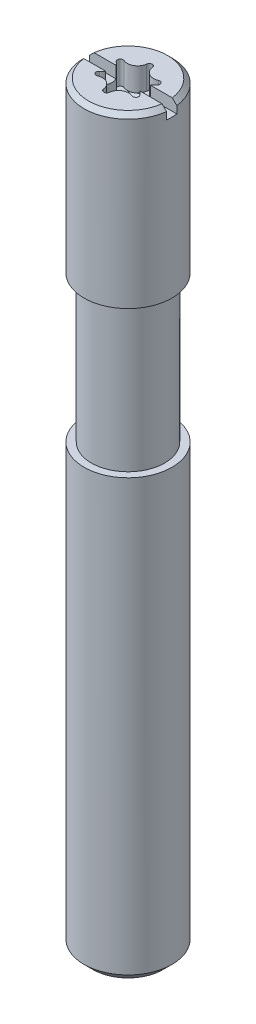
ISO-10303-21;
HEADER;
FILE_DESCRIPTION(('STEP AP214'),'2;1');
FILE_NAME('part.step','',(''),(''),'','','');
FILE_SCHEMA(('AUTOMOTIVE_DESIGN { 1 0 10303 214 1 1 1 1 }'));
ENDSEC;
DATA;
#1=APPLICATION_CONTEXT('core data for automotive mechanical design processes');
#2=APPLICATION_PROTOCOL_DEFINITION('international standard','automotive_design',2000,#1);
#3=PRODUCT_CONTEXT('',#1,'mechanical');
#4=PRODUCT('Part','Part','',(#3));
#5=PRODUCT_RELATED_PRODUCT_CATEGORY('part','',(#4));
#6=PRODUCT_DEFINITION_FORMATION('','',#4);
#7=PRODUCT_DEFINITION_CONTEXT('part definition',#1,'design');
#8=PRODUCT_DEFINITION('design','',#6,#7);
#9=PRODUCT_DEFINITION_SHAPE('','',#8);
#10=(LENGTH_UNIT() NAMED_UNIT(*) SI_UNIT(.MILLI.,.METRE.));
#11=(NAMED_UNIT(*) PLANE_ANGLE_UNIT() SI_UNIT($,.RADIAN.));
#12=(NAMED_UNIT(*) SI_UNIT($,.STERADIAN.) SOLID_ANGLE_UNIT());
#13=UNCERTAINTY_MEASURE_WITH_UNIT(LENGTH_MEASURE(1.E-05),#10,'distance_accuracy_value','');
#14=(GEOMETRIC_REPRESENTATION_CONTEXT(3) GLOBAL_UNCERTAINTY_ASSIGNED_CONTEXT((#13)) GLOBAL_UNIT_ASSIGNED_CONTEXT((#10,
#11,#12)) REPRESENTATION_CONTEXT('',''));
#15=CARTESIAN_POINT('',(0.,0.,0.));
#16=DIRECTION('',(0.,0.,1.));
#17=DIRECTION('',(1.,0.,0.));
#18=AXIS2_PLACEMENT_3D('',#15,#16,#17);
#19=CARTESIAN_POINT('',(-1.52237094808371,39.9,-0.362499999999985));
#20=DIRECTION('',(0.,1.,0.));
#21=DIRECTION('',(0.,0.,1.));
#22=AXIS2_PLACEMENT_3D('',#19,#20,#21);
#23=PLANE('',#22);
#24=CARTESIAN_POINT('',(-0.894502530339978,39.9,1.54932383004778));
#25=DIRECTION('',(0.,1.,0.));
#26=DIRECTION('',(0.,0.,1.));
#27=AXIS2_PLACEMENT_3D('',#24,#25,#26);
#28=CIRCLE('',#27,0.7);
#29=CARTESIAN_POINT('',(-0.198778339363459,39.9,1.47207196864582));
#30=VERTEX_POINT('',#29);
#31=CARTESIAN_POINT('',(-0.464026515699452,39.899999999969,0.997336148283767));
#32=VERTEX_POINT('',#31);
#33=EDGE_CURVE('E359',#30,#32,#28,.T.);
#34=ORIENTED_EDGE('',*,*,#33,.F.);
#35=CARTESIAN_POINT('',(0.,39.9,1.45));
#36=DIRECTION('',(0.,1.,0.));
#37=DIRECTION('',(0.,0.,1.));
#38=AXIS2_PLACEMENT_3D('',#35,#36,#37);
#39=CIRCLE('',#38,0.2);
#40=CARTESIAN_POINT('',(0.198778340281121,39.9,1.47207196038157));
#41=VERTEX_POINT('',#40);
#42=EDGE_CURVE('E568',#30,#41,#39,.T.);
#43=ORIENTED_EDGE('',*,*,#42,.T.);
#44=CARTESIAN_POINT('',(0.894502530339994,39.9,1.54932383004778));
#45=DIRECTION('',(0.,1.,0.));
#46=DIRECTION('',(0.,0.,1.));
#47=AXIS2_PLACEMENT_3D('',#44,#45,#46);
#48=CIRCLE('',#47,0.7);
#49=CARTESIAN_POINT('',(0.464026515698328,39.8999999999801,0.997336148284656));
#50=VERTEX_POINT('',#49);
#51=EDGE_CURVE('E634',#50,#41,#48,.T.);
#52=ORIENTED_EDGE('',*,*,#51,.F.);
#53=CARTESIAN_POINT('',(0.,39.8999999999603,0.));
#54=DIRECTION('',(0.,1.,0.));
#55=DIRECTION('',(0.,0.,1.));
#56=AXIS2_PLACEMENT_3D('',#53,#54,#55);
#57=CIRCLE('',#56,1.09999999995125);
#58=EDGE_CURVE('E595',#50,#32,#57,.F.);
#59=ORIENTED_EDGE('',*,*,#58,.T.);
#60=EDGE_LOOP('',(#34,#43,#52,#59));
#61=FACE_BOUND('',#60,.T.);
#62=ADVANCED_FACE('F14',(#61),#23,.T.);
#63=CARTESIAN_POINT('',(-1.52237094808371,39.9,-0.362499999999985));
#64=DIRECTION('',(0.,1.,0.));
#65=DIRECTION('',(0.,0.,1.));
#66=AXIS2_PLACEMENT_3D('',#63,#64,#65);
#67=PLANE('',#66);
#68=CARTESIAN_POINT('',(0.894502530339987,39.9,-1.54932383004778));
#69=DIRECTION('',(0.,1.,0.));
#70=DIRECTION('',(0.,0.,1.));
#71=AXIS2_PLACEMENT_3D('',#68,#69,#70);
#72=CIRCLE('',#71,0.7);
#73=CARTESIAN_POINT('',(0.198778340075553,39.9,-1.47207196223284));
#74=VERTEX_POINT('',#73);
#75=CARTESIAN_POINT('',(0.464026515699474,39.899999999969,-0.997336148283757));
#76=VERTEX_POINT('',#75);
#77=EDGE_CURVE('E631',#74,#76,#72,.T.);
#78=ORIENTED_EDGE('',*,*,#77,.F.);
#79=CARTESIAN_POINT('',(0.,39.9,-1.45));
#80=DIRECTION('',(0.,1.,0.));
#81=DIRECTION('',(0.,0.,1.));
#82=AXIS2_PLACEMENT_3D('',#79,#80,#81);
#83=CIRCLE('',#82,0.2);
#84=CARTESIAN_POINT('',(-0.198778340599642,39.9,-1.47207195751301));
#85=VERTEX_POINT('',#84);
#86=EDGE_CURVE('E643',#74,#85,#83,.T.);
#87=ORIENTED_EDGE('',*,*,#86,.T.);
#88=CARTESIAN_POINT('',(-0.894502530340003,39.9,-1.54932383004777));
#89=DIRECTION('',(0.,1.,0.));
#90=DIRECTION('',(0.,0.,1.));
#91=AXIS2_PLACEMENT_3D('',#88,#89,#90);
#92=CIRCLE('',#91,0.7);
#93=CARTESIAN_POINT('',(-0.46402651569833,39.8999999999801,-0.997336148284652));
#94=VERTEX_POINT('',#93);
#95=EDGE_CURVE('E279',#94,#85,#92,.T.);
#96=ORIENTED_EDGE('',*,*,#95,.F.);
#97=CARTESIAN_POINT('',(0.,39.8999999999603,0.));
#98=DIRECTION('',(0.,1.,0.));
#99=DIRECTION('',(0.,0.,1.));
#100=AXIS2_PLACEMENT_3D('',#97,#98,#99);
#101=CIRCLE('',#100,1.09999999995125);
#102=EDGE_CURVE('E647',#94,#76,#101,.F.);
#103=ORIENTED_EDGE('',*,*,#102,.T.);
#104=EDGE_LOOP('',(#78,#87,#96,#103));
#105=FACE_BOUND('',#104,.T.);
#106=ADVANCED_FACE('F314',(#105),#67,.T.);
#107=CARTESIAN_POINT('',(0.894502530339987,39.9,-1.54932383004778));
#108=DIRECTION('',(0.,1.,0.));
#109=DIRECTION('',(0.,0.,1.));
#110=AXIS2_PLACEMENT_3D('',#107,#108,#109);
#111=CYLINDRICAL_SURFACE('',#110,0.7);
#112=CARTESIAN_POINT('',(0.894502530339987,39.9,-1.54932383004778));
#113=DIRECTION('',(0.,1.,0.));
#114=DIRECTION('',(0.,0.,1.));
#115=AXIS2_PLACEMENT_3D('',#112,#113,#114);
#116=CIRCLE('',#115,0.7);
#117=CARTESIAN_POINT('',(0.631705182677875,39.8999999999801,-0.900526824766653));
#118=VERTEX_POINT('',#117);
#119=CARTESIAN_POINT('',(1.17546254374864,39.9,-0.908183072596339));
#120=VERTEX_POINT('',#119);
#121=EDGE_CURVE('E627',#118,#120,#116,.T.);
#122=ORIENTED_EDGE('',*,*,#121,.T.);
#123=DIRECTION('',(0.,1.,0.));
#124=VECTOR('',#123,1.);
#125=CARTESIAN_POINT('',(1.17546254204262,39.9,-0.908183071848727));
#126=LINE('',#125,#124);
#127=CARTESIAN_POINT('',(1.17546254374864,41.5,-0.908183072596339));
#128=VERTEX_POINT('',#127);
#129=EDGE_CURVE('E558',#120,#128,#126,.T.);
#130=ORIENTED_EDGE('',*,*,#129,.T.);
#131=CARTESIAN_POINT('',(0.894502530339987,41.5,-1.54932383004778));
#132=DIRECTION('',(0.,1.,0.));
#133=DIRECTION('',(0.,0.,1.));
#134=AXIS2_PLACEMENT_3D('',#131,#132,#133);
#135=CIRCLE('',#134,0.7);
#136=CARTESIAN_POINT('',(0.198778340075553,41.5,-1.47207196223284));
#137=VERTEX_POINT('',#136);
#138=EDGE_CURVE('E438',#128,#137,#135,.F.);
#139=ORIENTED_EDGE('',*,*,#138,.T.);
#140=DIRECTION('',(0.,1.,0.));
#141=VECTOR('',#140,1.);
#142=CARTESIAN_POINT('',(0.198778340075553,39.9,-1.47207196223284));
#143=LINE('',#142,#141);
#144=EDGE_CURVE('E628',#137,#74,#143,.F.);
#145=ORIENTED_EDGE('',*,*,#144,.T.);
#146=ORIENTED_EDGE('',*,*,#77,.T.);
#147=CARTESIAN_POINT('',(0.46402651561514,39.8999999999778,-0.997336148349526));
#148=CARTESIAN_POINT('',(0.489730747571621,39.8973321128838,-0.977317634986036));
#149=CARTESIAN_POINT('',(0.516556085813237,39.8959981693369,-0.959240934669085));
#150=CARTESIAN_POINT('',(0.572448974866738,39.8959981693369,-0.92697116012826));
#151=CARTESIAN_POINT('',(0.601516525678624,39.8973321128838,-0.912778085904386));
#152=CARTESIAN_POINT('',(0.631705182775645,39.8999999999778,-0.900526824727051));
#153=B_SPLINE_CURVE_WITH_KNOTS('',3,(#147,#148,#149,#150,#151,#152),.UNSPECIFIED.,.F.,.F.,(4,2,
4),(0.,0.097125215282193,0.194250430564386),.UNSPECIFIED.);
#154=EDGE_CURVE('E334',#76,#118,#153,.T.);
#155=ORIENTED_EDGE('',*,*,#154,.T.);
#156=EDGE_LOOP('',(#122,#130,#139,#145,#146,#155));
#157=FACE_BOUND('',#156,.T.);
#158=ADVANCED_FACE('F293',(#157),#111,.T.);
#159=CARTESIAN_POINT('',(0.,39.9,-1.45));
#160=DIRECTION('',(0.,1.,0.));
#161=DIRECTION('',(0.,0.,1.));
#162=AXIS2_PLACEMENT_3D('',#159,#160,#161);
#163=CYLINDRICAL_SURFACE('',#162,0.2);
#164=DIRECTION('',(0.,1.,0.));
#165=VECTOR('',#164,1.);
#166=CARTESIAN_POINT('',(-0.198778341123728,39.9,-1.47207195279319));
#167=LINE('',#166,#165);
#168=CARTESIAN_POINT('',(-0.198778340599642,41.5,-1.47207195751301));
#169=VERTEX_POINT('',#168);
#170=EDGE_CURVE('E458',#85,#169,#167,.T.);
#171=ORIENTED_EDGE('',*,*,#170,.F.);
#172=ORIENTED_EDGE('',*,*,#86,.F.);
#173=ORIENTED_EDGE('',*,*,#144,.F.);
#174=CARTESIAN_POINT('',(0.,41.5,-1.45));
#175=DIRECTION('',(0.,1.,0.));
#176=DIRECTION('',(0.,0.,1.));
#177=AXIS2_PLACEMENT_3D('',#174,#175,#176);
#178=CIRCLE('',#177,0.2);
#179=EDGE_CURVE('E642',#169,#137,#178,.F.);
#180=ORIENTED_EDGE('',*,*,#179,.F.);
#181=EDGE_LOOP('',(#171,#172,#173,#180));
#182=FACE_BOUND('',#181,.T.);
#183=ADVANCED_FACE('F291',(#182),#163,.F.);
#184=CARTESIAN_POINT('',(-0.894502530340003,39.9,-1.54932383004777));
#185=DIRECTION('',(0.,1.,0.));
#186=DIRECTION('',(0.,0.,1.));
#187=AXIS2_PLACEMENT_3D('',#184,#185,#186);
#188=CYLINDRICAL_SURFACE('',#187,0.7);
#189=ORIENTED_EDGE('',*,*,#95,.T.);
#190=ORIENTED_EDGE('',*,*,#170,.T.);
#191=CARTESIAN_POINT('',(-0.894502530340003,41.5,-1.54932383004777));
#192=DIRECTION('',(0.,1.,0.));
#193=DIRECTION('',(0.,0.,1.));
#194=AXIS2_PLACEMENT_3D('',#191,#192,#193);
#195=CIRCLE('',#194,0.7);
#196=CARTESIAN_POINT('',(-1.17546253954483,41.5,-0.908183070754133));
#197=VERTEX_POINT('',#196);
#198=EDGE_CURVE('E435',#169,#197,#195,.F.);
#199=ORIENTED_EDGE('',*,*,#198,.T.);
#200=DIRECTION('',(0.,1.,0.));
#201=VECTOR('',#200,1.);
#202=CARTESIAN_POINT('',(-1.17546253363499,39.9,-0.908183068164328));
#203=LINE('',#202,#201);
#204=CARTESIAN_POINT('',(-1.17546253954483,39.9,-0.908183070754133));
#205=VERTEX_POINT('',#204);
#206=EDGE_CURVE('E615',#197,#205,#203,.F.);
#207=ORIENTED_EDGE('',*,*,#206,.T.);
#208=CARTESIAN_POINT('',(-0.894502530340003,39.9,-1.54932383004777));
#209=DIRECTION('',(0.,1.,0.));
#210=DIRECTION('',(0.,0.,1.));
#211=AXIS2_PLACEMENT_3D('',#208,#209,#210);
#212=CIRCLE('',#211,0.7);
#213=CARTESIAN_POINT('',(-0.631705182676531,39.899999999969,-0.900526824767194));
#214=VERTEX_POINT('',#213);
#215=EDGE_CURVE('E304',#205,#214,#212,.T.);
#216=ORIENTED_EDGE('',*,*,#215,.T.);
#217=CARTESIAN_POINT('',(-0.631705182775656,39.8999999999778,-0.900526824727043));
#218=CARTESIAN_POINT('',(-0.601516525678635,39.8973321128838,-0.912778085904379));
#219=CARTESIAN_POINT('',(-0.572448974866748,39.8959981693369,-0.926971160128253));
#220=CARTESIAN_POINT('',(-0.516556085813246,39.8959981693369,-0.959240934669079));
#221=CARTESIAN_POINT('',(-0.48973074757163,39.8973321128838,-0.977317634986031));
#222=CARTESIAN_POINT('',(-0.464026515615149,39.8999999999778,-0.997336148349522));
#223=B_SPLINE_CURVE_WITH_KNOTS('',3,(#217,#218,#219,#220,#221,#222),.UNSPECIFIED.,.F.,.F.,(4,2,
4),(0.,0.0971252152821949,0.19425043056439),.UNSPECIFIED.);
#224=EDGE_CURVE('E296',#214,#94,#223,.T.);
#225=ORIENTED_EDGE('',*,*,#224,.T.);
#226=EDGE_LOOP('',(#189,#190,#199,#207,#216,#225));
#227=FACE_BOUND('',#226,.T.);
#228=ADVANCED_FACE('F286',(#227),#188,.T.);
#229=CARTESIAN_POINT('',(-1.25573683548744,39.9,-0.724999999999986));
#230=DIRECTION('',(0.,1.,0.));
#231=DIRECTION('',(0.,0.,1.));
#232=AXIS2_PLACEMENT_3D('',#229,#230,#231);
#233=CYLINDRICAL_SURFACE('',#232,0.2);
#234=DIRECTION('',(0.,1.,0.));
#235=VECTOR('',#234,1.);
#236=CARTESIAN_POINT('',(-1.37424087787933,39.9,-0.563888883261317));
#237=LINE('',#236,#235);
#238=CARTESIAN_POINT('',(-1.37424088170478,39.9,-0.563888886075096));
#239=VERTEX_POINT('',#238);
#240=CARTESIAN_POINT('',(-1.37424088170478,41.5,-0.563888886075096));
#241=VERTEX_POINT('',#240);
#242=EDGE_CURVE('E469',#239,#241,#237,.T.);
#243=ORIENTED_EDGE('',*,*,#242,.F.);
#244=CARTESIAN_POINT('',(-1.25573683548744,39.9,-0.724999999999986));
#245=DIRECTION('',(0.,1.,0.));
#246=DIRECTION('',(0.,0.,1.));
#247=AXIS2_PLACEMENT_3D('',#244,#245,#246);
#248=CIRCLE('',#247,0.2);
#249=EDGE_CURVE('E609',#205,#239,#248,.T.);
#250=ORIENTED_EDGE('',*,*,#249,.F.);
#251=ORIENTED_EDGE('',*,*,#206,.F.);
#252=CARTESIAN_POINT('',(-1.25573683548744,41.5,-0.724999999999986));
#253=DIRECTION('',(0.,1.,0.));
#254=DIRECTION('',(0.,0.,1.));
#255=AXIS2_PLACEMENT_3D('',#252,#253,#254);
#256=CIRCLE('',#255,0.2);
#257=EDGE_CURVE('E472',#241,#197,#256,.F.);
#258=ORIENTED_EDGE('',*,*,#257,.F.);
#259=EDGE_LOOP('',(#243,#250,#251,#258));
#260=FACE_BOUND('',#259,.T.);
#261=ADVANCED_FACE('F290',(#260),#233,.F.);
#262=CARTESIAN_POINT('',(-1.52237094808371,39.9,-0.362499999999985));
#263=DIRECTION('',(0.,1.,0.));
#264=DIRECTION('',(0.,0.,1.));
#265=AXIS2_PLACEMENT_3D('',#262,#263,#264);
#266=PLANE('',#265);
#267=ORIENTED_EDGE('',*,*,#215,.F.);
#268=ORIENTED_EDGE('',*,*,#249,.T.);
#269=CARTESIAN_POINT('',(-1.78900506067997,39.9,0.));
#270=DIRECTION('',(0.,1.,0.));
#271=DIRECTION('',(0.,0.,1.));
#272=AXIS2_PLACEMENT_3D('',#269,#270,#271);
#273=CIRCLE('',#272,0.7);
#274=CARTESIAN_POINT('',(-1.09573169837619,39.8999999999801,-0.0968093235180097));
#275=VERTEX_POINT('',#274);
#276=EDGE_CURVE('E516',#275,#239,#273,.T.);
#277=ORIENTED_EDGE('',*,*,#276,.F.);
#278=CARTESIAN_POINT('',(0.,39.8999999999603,0.));
#279=DIRECTION('',(0.,1.,0.));
#280=DIRECTION('',(0.,0.,1.));
#281=AXIS2_PLACEMENT_3D('',#278,#279,#280);
#282=CIRCLE('',#281,1.09999999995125);
#283=EDGE_CURVE('E600',#275,#214,#282,.F.);
#284=ORIENTED_EDGE('',*,*,#283,.T.);
#285=EDGE_LOOP('',(#267,#268,#277,#284));
#286=FACE_BOUND('',#285,.T.);
#287=ADVANCED_FACE('F316',(#286),#266,.T.);
#288=CARTESIAN_POINT('',(-1.52237094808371,39.9,-0.362499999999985));
#289=DIRECTION('',(0.,1.,0.));
#290=DIRECTION('',(0.,0.,1.));
#291=AXIS2_PLACEMENT_3D('',#288,#289,#290);
#292=PLANE('',#291);
#293=CARTESIAN_POINT('',(-1.78900506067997,39.9,0.));
#294=DIRECTION('',(0.,1.,0.));
#295=DIRECTION('',(0.,0.,1.));
#296=AXIS2_PLACEMENT_3D('',#293,#294,#295);
#297=CIRCLE('',#296,0.7);
#298=CARTESIAN_POINT('',(-1.09573169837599,39.8999999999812,0.0968093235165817));
#299=VERTEX_POINT('',#298);
#300=CARTESIAN_POINT('',(-1.37424089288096,39.9,0.563888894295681));
#301=VERTEX_POINT('',#300);
#302=EDGE_CURVE('E464',#299,#301,#297,.F.);
#303=ORIENTED_EDGE('',*,*,#302,.T.);
#304=CARTESIAN_POINT('',(-1.25573683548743,39.9,0.725000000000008));
#305=DIRECTION('',(0.,1.,0.));
#306=DIRECTION('',(0.,0.,1.));
#307=AXIS2_PLACEMENT_3D('',#304,#305,#306);
#308=CIRCLE('',#307,0.2);
#309=CARTESIAN_POINT('',(-1.17546254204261,39.9,0.90818307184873));
#310=VERTEX_POINT('',#309);
#311=EDGE_CURVE('E485',#301,#310,#308,.T.);
#312=ORIENTED_EDGE('',*,*,#311,.T.);
#313=CARTESIAN_POINT('',(-0.894502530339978,39.9,1.54932383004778));
#314=DIRECTION('',(0.,1.,0.));
#315=DIRECTION('',(0.,0.,1.));
#316=AXIS2_PLACEMENT_3D('',#313,#314,#315);
#317=CIRCLE('',#316,0.7);
#318=CARTESIAN_POINT('',(-0.631705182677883,39.8999999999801,0.900526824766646));
#319=VERTEX_POINT('',#318);
#320=EDGE_CURVE('E358',#319,#310,#317,.T.);
#321=ORIENTED_EDGE('',*,*,#320,.F.);
#322=CARTESIAN_POINT('',(0.,39.8999999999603,0.));
#323=DIRECTION('',(0.,1.,0.));
#324=DIRECTION('',(0.,0.,1.));
#325=AXIS2_PLACEMENT_3D('',#322,#323,#324);
#326=CIRCLE('',#325,1.09999999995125);
#327=EDGE_CURVE('E597',#319,#299,#326,.F.);
#328=ORIENTED_EDGE('',*,*,#327,.T.);
#329=EDGE_LOOP('',(#303,#312,#321,#328));
#330=FACE_BOUND('',#329,.T.);
#331=ADVANCED_FACE('F530',(#330),#292,.T.);
#332=CARTESIAN_POINT('',(-1.25573683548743,39.9,0.725000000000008));
#333=DIRECTION('',(0.,1.,0.));
#334=DIRECTION('',(0.,0.,1.));
#335=AXIS2_PLACEMENT_3D('',#332,#333,#334);
#336=CYLINDRICAL_SURFACE('',#335,0.2);
#337=DIRECTION('',(0.,1.,0.));
#338=VECTOR('',#337,1.);
#339=CARTESIAN_POINT('',(-1.17546253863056,39.9,0.908183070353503));
#340=LINE('',#339,#338);
#341=CARTESIAN_POINT('',(-1.17546254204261,41.5,0.90818307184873));
#342=VERTEX_POINT('',#341);
#343=EDGE_CURVE('E587',#310,#342,#340,.T.);
#344=ORIENTED_EDGE('',*,*,#343,.F.);
#345=ORIENTED_EDGE('',*,*,#311,.F.);
#346=DIRECTION('',(0.,1.,0.));
#347=VECTOR('',#346,1.);
#348=CARTESIAN_POINT('',(-1.3742409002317,39.9,0.563888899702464));
#349=LINE('',#348,#347);
#350=CARTESIAN_POINT('',(-1.37424089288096,41.5,0.563888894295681));
#351=VERTEX_POINT('',#350);
#352=EDGE_CURVE('E483',#351,#301,#349,.F.);
#353=ORIENTED_EDGE('',*,*,#352,.F.);
#354=CARTESIAN_POINT('',(-1.25573683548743,41.5,0.725000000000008));
#355=DIRECTION('',(0.,1.,0.));
#356=DIRECTION('',(0.,0.,1.));
#357=AXIS2_PLACEMENT_3D('',#354,#355,#356);
#358=CIRCLE('',#357,0.2);
#359=EDGE_CURVE('E482',#342,#351,#358,.F.);
#360=ORIENTED_EDGE('',*,*,#359,.F.);
#361=EDGE_LOOP('',(#344,#345,#353,#360));
#362=FACE_BOUND('',#361,.T.);
#363=ADVANCED_FACE('F366',(#362),#336,.F.);
#364=CARTESIAN_POINT('',(-0.894502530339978,39.9,1.54932383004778));
#365=DIRECTION('',(0.,1.,0.));
#366=DIRECTION('',(0.,0.,1.));
#367=AXIS2_PLACEMENT_3D('',#364,#365,#366);
#368=CYLINDRICAL_SURFACE('',#367,0.7);
#369=ORIENTED_EDGE('',*,*,#320,.T.);
#370=ORIENTED_EDGE('',*,*,#343,.T.);
#371=CARTESIAN_POINT('',(-0.894502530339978,41.5,1.54932383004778));
#372=DIRECTION('',(0.,1.,0.));
#373=DIRECTION('',(0.,0.,1.));
#374=AXIS2_PLACEMENT_3D('',#371,#372,#373);
#375=CIRCLE('',#374,0.7);
#376=CARTESIAN_POINT('',(-0.198778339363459,41.5,1.47207196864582));
#377=VERTEX_POINT('',#376);
#378=EDGE_CURVE('E277',#342,#377,#375,.F.);
#379=ORIENTED_EDGE('',*,*,#378,.T.);
#380=DIRECTION('',(0.,1.,0.));
#381=VECTOR('',#380,1.);
#382=CARTESIAN_POINT('',(-0.198778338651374,39.9,1.4720719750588));
#383=LINE('',#382,#381);
#384=EDGE_CURVE('E636',#377,#30,#383,.F.);
#385=ORIENTED_EDGE('',*,*,#384,.T.);
#386=ORIENTED_EDGE('',*,*,#33,.T.);
#387=CARTESIAN_POINT('',(-0.464026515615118,39.8999999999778,0.997336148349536));
#388=CARTESIAN_POINT('',(-0.489730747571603,39.8973321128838,0.977317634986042));
#389=CARTESIAN_POINT('',(-0.516556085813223,39.8959981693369,0.959240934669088));
#390=CARTESIAN_POINT('',(-0.572448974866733,39.8959981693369,0.926971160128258));
#391=CARTESIAN_POINT('',(-0.601516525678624,39.8973321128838,0.912778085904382));
#392=CARTESIAN_POINT('',(-0.63170518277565,39.8999999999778,0.900526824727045));
#393=B_SPLINE_CURVE_WITH_KNOTS('',3,(#387,#388,#389,#390,#391,#392),.UNSPECIFIED.,.F.,.F.,(4,2,
4),(0.,0.0971252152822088,0.194250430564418),.UNSPECIFIED.);
#394=EDGE_CURVE('E349',#32,#319,#393,.T.);
#395=ORIENTED_EDGE('',*,*,#394,.T.);
#396=EDGE_LOOP('',(#369,#370,#379,#385,#386,#395));
#397=FACE_BOUND('',#396,.T.);
#398=ADVANCED_FACE('F361',(#397),#368,.T.);
#399=CARTESIAN_POINT('',(0.,39.9,1.45));
#400=DIRECTION('',(0.,1.,0.));
#401=DIRECTION('',(0.,0.,1.));
#402=AXIS2_PLACEMENT_3D('',#399,#400,#401);
#403=CYLINDRICAL_SURFACE('',#402,0.2);
#404=DIRECTION('',(0.,1.,0.));
#405=VECTOR('',#404,1.);
#406=CARTESIAN_POINT('',(0.198778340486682,39.9,1.4720719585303));
#407=LINE('',#406,#405);
#408=CARTESIAN_POINT('',(0.198778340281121,41.5,1.47207196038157));
#409=VERTEX_POINT('',#408);
#410=EDGE_CURVE('E632',#41,#409,#407,.T.);
#411=ORIENTED_EDGE('',*,*,#410,.F.);
#412=ORIENTED_EDGE('',*,*,#42,.F.);
#413=ORIENTED_EDGE('',*,*,#384,.F.);
#414=CARTESIAN_POINT('',(0.,41.5,1.45));
#415=DIRECTION('',(0.,1.,0.));
#416=DIRECTION('',(0.,0.,1.));
#417=AXIS2_PLACEMENT_3D('',#414,#415,#416);
#418=CIRCLE('',#417,0.2);
#419=EDGE_CURVE('E566',#409,#377,#418,.F.);
#420=ORIENTED_EDGE('',*,*,#419,.F.);
#421=EDGE_LOOP('',(#411,#412,#413,#420));
#422=FACE_BOUND('',#421,.T.);
#423=ADVANCED_FACE('F365',(#422),#403,.F.);
#424=CARTESIAN_POINT('',(0.894502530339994,39.9,1.54932383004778));
#425=DIRECTION('',(0.,1.,0.));
#426=DIRECTION('',(0.,0.,1.));
#427=AXIS2_PLACEMENT_3D('',#424,#425,#426);
#428=CYLINDRICAL_SURFACE('',#427,0.7);
#429=ORIENTED_EDGE('',*,*,#51,.T.);
#430=ORIENTED_EDGE('',*,*,#410,.T.);
#431=CARTESIAN_POINT('',(0.894502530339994,41.5,1.54932383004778));
#432=DIRECTION('',(0.,1.,0.));
#433=DIRECTION('',(0.,0.,1.));
#434=AXIS2_PLACEMENT_3D('',#431,#432,#433);
#435=CIRCLE('',#434,0.7);
#436=CARTESIAN_POINT('',(1.17546253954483,41.5,0.908183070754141));
#437=VERTEX_POINT('',#436);
#438=EDGE_CURVE('E440',#409,#437,#435,.F.);
#439=ORIENTED_EDGE('',*,*,#438,.T.);
#440=DIRECTION('',(0.,1.,0.));
#441=VECTOR('',#440,1.);
#442=CARTESIAN_POINT('',(1.17546253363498,39.9,0.908183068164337));
#443=LINE('',#442,#441);
#444=CARTESIAN_POINT('',(1.17546253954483,39.9,0.908183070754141));
#445=VERTEX_POINT('',#444);
#446=EDGE_CURVE('E588',#437,#445,#443,.F.);
#447=ORIENTED_EDGE('',*,*,#446,.T.);
#448=CARTESIAN_POINT('',(0.894502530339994,39.9,1.54932383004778));
#449=DIRECTION('',(0.,1.,0.));
#450=DIRECTION('',(0.,0.,1.));
#451=AXIS2_PLACEMENT_3D('',#448,#449,#450);
#452=CIRCLE('',#451,0.7);
#453=CARTESIAN_POINT('',(0.631705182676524,39.899999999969,0.900526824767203));
#454=VERTEX_POINT('',#453);
#455=EDGE_CURVE('E635',#445,#454,#452,.T.);
#456=ORIENTED_EDGE('',*,*,#455,.T.);
#457=CARTESIAN_POINT('',(0.631705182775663,39.8999999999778,0.900526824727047));
#458=CARTESIAN_POINT('',(0.601516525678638,39.8973321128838,0.912778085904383));
#459=CARTESIAN_POINT('',(0.572448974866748,39.8959981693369,0.926971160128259));
#460=CARTESIAN_POINT('',(0.516556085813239,39.8959981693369,0.959240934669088));
#461=CARTESIAN_POINT('',(0.48973074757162,39.8973321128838,0.977317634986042));
#462=CARTESIAN_POINT('',(0.464026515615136,39.8999999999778,0.997336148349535));
#463=B_SPLINE_CURVE_WITH_KNOTS('',3,(#457,#458,#459,#460,#461,#462),.UNSPECIFIED.,.F.,.F.,(4,2,
4),(0.,0.097125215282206,0.194250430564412),.UNSPECIFIED.);
#464=EDGE_CURVE('E341',#454,#50,#463,.T.);
#465=ORIENTED_EDGE('',*,*,#464,.T.);
#466=EDGE_LOOP('',(#429,#430,#439,#447,#456,#465));
#467=FACE_BOUND('',#466,.T.);
#468=ADVANCED_FACE('F368',(#467),#428,.T.);
#469=CARTESIAN_POINT('',(-1.52237094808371,39.9,-0.362499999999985));
#470=DIRECTION('',(0.,1.,0.));
#471=DIRECTION('',(0.,0.,1.));
#472=AXIS2_PLACEMENT_3D('',#469,#470,#471);
#473=PLANE('',#472);
#474=ORIENTED_EDGE('',*,*,#455,.F.);
#475=CARTESIAN_POINT('',(1.25573683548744,39.9,0.725));
#476=DIRECTION('',(0.,1.,0.));
#477=DIRECTION('',(0.,0.,1.));
#478=AXIS2_PLACEMENT_3D('',#475,#476,#477);
#479=CIRCLE('',#478,0.2);
#480=CARTESIAN_POINT('',(1.37424088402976,39.9,0.563888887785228));
#481=VERTEX_POINT('',#480);
#482=EDGE_CURVE('E570',#445,#481,#479,.T.);
#483=ORIENTED_EDGE('',*,*,#482,.T.);
#484=CARTESIAN_POINT('',(1.78900506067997,39.9,0.));
#485=DIRECTION('',(0.,1.,0.));
#486=DIRECTION('',(0.,0.,1.));
#487=AXIS2_PLACEMENT_3D('',#484,#485,#486);
#488=CIRCLE('',#487,0.7);
#489=CARTESIAN_POINT('',(1.09573169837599,39.8999999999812,0.0968093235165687));
#490=VERTEX_POINT('',#489);
#491=EDGE_CURVE('E573',#481,#490,#488,.F.);
#492=ORIENTED_EDGE('',*,*,#491,.T.);
#493=CARTESIAN_POINT('',(0.,39.8999999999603,0.));
#494=DIRECTION('',(0.,1.,0.));
#495=DIRECTION('',(0.,0.,1.));
#496=AXIS2_PLACEMENT_3D('',#493,#494,#495);
#497=CIRCLE('',#496,1.09999999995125);
#498=EDGE_CURVE('E604',#490,#454,#497,.F.);
#499=ORIENTED_EDGE('',*,*,#498,.T.);
#500=EDGE_LOOP('',(#474,#483,#492,#499));
#501=FACE_BOUND('',#500,.T.);
#502=ADVANCED_FACE('F312',(#501),#473,.T.);
#503=CARTESIAN_POINT('',(0.,39.8999999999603,0.));
#504=DIRECTION('',(0.,1.,0.));
#505=DIRECTION('',(0.,0.,1.));
#506=AXIS2_PLACEMENT_3D('',#503,#504,#505);
#507=CONICAL_SURFACE('',#506,1.09999999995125,1.22173047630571);
#508=CARTESIAN_POINT('',(1.13686837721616E-10,39.4996327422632,0.));
#509=VERTEX_POINT('',#508);
#510=VERTEX_LOOP('',#509);
#511=FACE_BOUND('',#510,.T.);
#512=CARTESIAN_POINT('',(0.,39.8999999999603,0.));
#513=DIRECTION('',(0.,1.,0.));
#514=DIRECTION('',(0.,0.,1.));
#515=AXIS2_PLACEMENT_3D('',#512,#513,#514);
#516=CIRCLE('',#515,1.09999999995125);
#517=CARTESIAN_POINT('',(1.09573169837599,39.8999999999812,-0.0968093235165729));
#518=VERTEX_POINT('',#517);
#519=EDGE_CURVE('E602',#118,#518,#516,.F.);
#520=ORIENTED_EDGE('',*,*,#519,.F.);
#521=ORIENTED_EDGE('',*,*,#154,.F.);
#522=ORIENTED_EDGE('',*,*,#102,.F.);
#523=ORIENTED_EDGE('',*,*,#224,.F.);
#524=ORIENTED_EDGE('',*,*,#283,.F.);
#525=CARTESIAN_POINT('',(-1.09573169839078,39.8999999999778,0.0968093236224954));
#526=CARTESIAN_POINT('',(-1.09124727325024,39.8973321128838,0.0645395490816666));
#527=CARTESIAN_POINT('',(-1.08900506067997,39.8959981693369,0.0322697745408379));
#528=CARTESIAN_POINT('',(-1.08900506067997,39.8959981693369,-0.0322697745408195));
#529=CARTESIAN_POINT('',(-1.09124727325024,39.8973321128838,-0.0645395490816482));
#530=CARTESIAN_POINT('',(-1.09573169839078,39.8999999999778,-0.0968093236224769));
#531=B_SPLINE_CURVE_WITH_KNOTS('',3,(#525,#526,#527,#528,#529,#530),.UNSPECIFIED.,.F.,.F.,(4,2,
4),(0.,0.097125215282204,0.194250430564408),.UNSPECIFIED.);
#532=EDGE_CURVE('E321',#299,#275,#531,.T.);
#533=ORIENTED_EDGE('',*,*,#532,.F.);
#534=ORIENTED_EDGE('',*,*,#327,.F.);
#535=ORIENTED_EDGE('',*,*,#394,.F.);
#536=ORIENTED_EDGE('',*,*,#58,.F.);
#537=ORIENTED_EDGE('',*,*,#464,.F.);
#538=ORIENTED_EDGE('',*,*,#498,.F.);
#539=CARTESIAN_POINT('',(1.09573169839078,39.8999999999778,-0.0968093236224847));
#540=CARTESIAN_POINT('',(1.09124727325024,39.8973321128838,-0.0645395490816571));
#541=CARTESIAN_POINT('',(1.08900506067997,39.8959981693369,-0.0322697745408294));
#542=CARTESIAN_POINT('',(1.08900506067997,39.8959981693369,0.0322697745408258));
#543=CARTESIAN_POINT('',(1.09124727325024,39.8973321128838,0.0645395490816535));
#544=CARTESIAN_POINT('',(1.09573169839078,39.8999999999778,0.0968093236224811));
#545=B_SPLINE_CURVE_WITH_KNOTS('',3,(#539,#540,#541,#542,#543,#544),.UNSPECIFIED.,.F.,.F.,(4,2,
4),(0.,0.0971252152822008,0.194250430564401),.UNSPECIFIED.);
#546=EDGE_CURVE('E538',#518,#490,#545,.T.);
#547=ORIENTED_EDGE('',*,*,#546,.F.);
#548=EDGE_LOOP('',(#520,#521,#522,#523,#524,#533,#534,#535,#536,#537,#538,#547));
#549=FACE_BOUND('',#548,.T.);
#550=ADVANCED_FACE('F306',(#511,#549),#507,.F.);
#551=CARTESIAN_POINT('',(-1.52237094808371,39.9,-0.362499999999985));
#552=DIRECTION('',(0.,1.,0.));
#553=DIRECTION('',(0.,0.,1.));
#554=AXIS2_PLACEMENT_3D('',#551,#552,#553);
#555=PLANE('',#554);
#556=CARTESIAN_POINT('',(1.78900506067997,39.9,0.));
#557=DIRECTION('',(0.,1.,0.));
#558=DIRECTION('',(0.,0.,1.));
#559=AXIS2_PLACEMENT_3D('',#556,#557,#558);
#560=CIRCLE('',#559,0.7);
#561=CARTESIAN_POINT('',(1.37424088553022,39.9,-0.563888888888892));
#562=VERTEX_POINT('',#561);
#563=EDGE_CURVE('E477',#518,#562,#560,.F.);
#564=ORIENTED_EDGE('',*,*,#563,.T.);
#565=CARTESIAN_POINT('',(1.25573683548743,39.9,-0.725));
#566=DIRECTION('',(0.,1.,0.));
#567=DIRECTION('',(0.,0.,1.));
#568=AXIS2_PLACEMENT_3D('',#565,#566,#567);
#569=CIRCLE('',#568,0.2);
#570=EDGE_CURVE('E476',#562,#120,#569,.T.);
#571=ORIENTED_EDGE('',*,*,#570,.T.);
#572=ORIENTED_EDGE('',*,*,#121,.F.);
#573=ORIENTED_EDGE('',*,*,#519,.T.);
#574=EDGE_LOOP('',(#564,#571,#572,#573));
#575=FACE_BOUND('',#574,.T.);
#576=ADVANCED_FACE('F311',(#575),#555,.T.);
#577=CARTESIAN_POINT('',(1.25573683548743,39.9,-0.725));
#578=DIRECTION('',(0.,1.,0.));
#579=DIRECTION('',(0.,0.,1.));
#580=AXIS2_PLACEMENT_3D('',#577,#578,#579);
#581=CYLINDRICAL_SURFACE('',#580,0.2);
#582=ORIENTED_EDGE('',*,*,#129,.F.);
#583=ORIENTED_EDGE('',*,*,#570,.F.);
#584=DIRECTION('',(0.,1.,0.));
#585=VECTOR('',#584,1.);
#586=CARTESIAN_POINT('',(1.37424088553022,39.9,-0.563888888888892));
#587=LINE('',#586,#585);
#588=CARTESIAN_POINT('',(1.37424088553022,41.5,-0.563888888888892));
#589=VERTEX_POINT('',#588);
#590=EDGE_CURVE('E474',#589,#562,#587,.F.);
#591=ORIENTED_EDGE('',*,*,#590,.F.);
#592=CARTESIAN_POINT('',(1.25573683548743,41.5,-0.725));
#593=DIRECTION('',(0.,1.,0.));
#594=DIRECTION('',(0.,0.,1.));
#595=AXIS2_PLACEMENT_3D('',#592,#593,#594);
#596=CIRCLE('',#595,0.2);
#597=EDGE_CURVE('E473',#128,#589,#596,.F.);
#598=ORIENTED_EDGE('',*,*,#597,.F.);
#599=EDGE_LOOP('',(#582,#583,#591,#598));
#600=FACE_BOUND('',#599,.T.);
#601=ADVANCED_FACE('F557',(#600),#581,.F.);
#602=CARTESIAN_POINT('',(1.25573683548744,39.9,0.725));
#603=DIRECTION('',(0.,1.,0.));
#604=DIRECTION('',(0.,0.,1.));
#605=AXIS2_PLACEMENT_3D('',#602,#603,#604);
#606=CYLINDRICAL_SURFACE('',#605,0.2);
#607=DIRECTION('',(0.,1.,0.));
#608=VECTOR('',#607,1.);
#609=CARTESIAN_POINT('',(1.3742408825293,39.9,0.563888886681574));
#610=LINE('',#609,#608);
#611=CARTESIAN_POINT('',(1.37424088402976,41.5,0.563888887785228));
#612=VERTEX_POINT('',#611);
#613=EDGE_CURVE('E478',#481,#612,#610,.T.);
#614=ORIENTED_EDGE('',*,*,#613,.F.);
#615=ORIENTED_EDGE('',*,*,#482,.F.);
#616=ORIENTED_EDGE('',*,*,#446,.F.);
#617=CARTESIAN_POINT('',(1.25573683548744,41.5,0.725));
#618=DIRECTION('',(0.,1.,0.));
#619=DIRECTION('',(0.,0.,1.));
#620=AXIS2_PLACEMENT_3D('',#617,#618,#619);
#621=CIRCLE('',#620,0.2);
#622=EDGE_CURVE('E481',#612,#437,#621,.F.);
#623=ORIENTED_EDGE('',*,*,#622,.F.);
#624=EDGE_LOOP('',(#614,#615,#616,#623));
#625=FACE_BOUND('',#624,.T.);
#626=ADVANCED_FACE('F659',(#625),#606,.F.);
#627=CARTESIAN_POINT('',(0.,41.5,0.));
#628=DIRECTION('',(0.,-1.,0.));
#629=DIRECTION('',(0.,0.,-1.));
#630=AXIS2_PLACEMENT_3D('',#627,#628,#629);
#631=PLANE('',#630);
#632=CARTESIAN_POINT('',(0.,41.4999999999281,0.));
#633=DIRECTION('',(0.,-1.,0.));
#634=DIRECTION('',(0.,0.,-1.));
#635=AXIS2_PLACEMENT_3D('',#632,#633,#634);
#636=CIRCLE('',#635,2.69350000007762);
#637=CARTESIAN_POINT('',(-2.67066326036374,41.4999999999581,-0.35));
#638=VERTEX_POINT('',#637);
#639=CARTESIAN_POINT('',(2.67066326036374,41.4999999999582,-0.35));
#640=VERTEX_POINT('',#639);
#641=EDGE_CURVE('E224',#638,#640,#636,.T.);
#642=ORIENTED_EDGE('',*,*,#641,.F.);
#643=DIRECTION('',(1.,0.,0.));
#644=VECTOR('',#643,1.);
#645=CARTESIAN_POINT('',(0.,41.5,-0.35));
#646=LINE('',#645,#644);
#647=CARTESIAN_POINT('',(-1.18278727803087,41.5,-0.35));
#648=VERTEX_POINT('',#647);
#649=EDGE_CURVE('E251',#648,#638,#646,.F.);
#650=ORIENTED_EDGE('',*,*,#649,.F.);
#651=CARTESIAN_POINT('',(-1.78900506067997,41.5,0.));
#652=DIRECTION('',(0.,1.,0.));
#653=DIRECTION('',(0.,0.,1.));
#654=AXIS2_PLACEMENT_3D('',#651,#652,#653);
#655=CIRCLE('',#654,0.7);
#656=EDGE_CURVE('E490',#241,#648,#655,.F.);
#657=ORIENTED_EDGE('',*,*,#656,.F.);
#658=ORIENTED_EDGE('',*,*,#257,.T.);
#659=ORIENTED_EDGE('',*,*,#198,.F.);
#660=ORIENTED_EDGE('',*,*,#179,.T.);
#661=ORIENTED_EDGE('',*,*,#138,.F.);
#662=ORIENTED_EDGE('',*,*,#597,.T.);
#663=CARTESIAN_POINT('',(1.78900506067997,41.5,0.));
#664=DIRECTION('',(0.,1.,0.));
#665=DIRECTION('',(0.,0.,1.));
#666=AXIS2_PLACEMENT_3D('',#663,#664,#665);
#667=CIRCLE('',#666,0.7);
#668=CARTESIAN_POINT('',(1.18278727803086,41.5,-0.35));
#669=VERTEX_POINT('',#668);
#670=EDGE_CURVE('E497',#669,#589,#667,.F.);
#671=ORIENTED_EDGE('',*,*,#670,.F.);
#672=DIRECTION('',(1.,0.,0.));
#673=VECTOR('',#672,1.);
#674=CARTESIAN_POINT('',(0.,41.5,-0.35));
#675=LINE('',#674,#673);
#676=EDGE_CURVE('E225',#640,#669,#675,.F.);
#677=ORIENTED_EDGE('',*,*,#676,.F.);
#678=EDGE_LOOP('',(#642,#650,#657,#658,#659,#660,#661,#662,#671,#677));
#679=FACE_BOUND('',#678,.T.);
#680=ADVANCED_FACE('F534',(#679),#631,.F.);
#681=CARTESIAN_POINT('',(-1.78900506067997,39.9,0.));
#682=DIRECTION('',(0.,1.,0.));
#683=DIRECTION('',(0.,0.,1.));
#684=AXIS2_PLACEMENT_3D('',#681,#682,#683);
#685=CYLINDRICAL_SURFACE('',#684,0.7);
#686=DIRECTION('',(0.,1.,0.));
#687=VECTOR('',#686,1.);
#688=CARTESIAN_POINT('',(-1.18278727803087,39.9,-0.35));
#689=LINE('',#688,#687);
#690=CARTESIAN_POINT('',(-1.18278727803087,40.7,-0.35));
#691=VERTEX_POINT('',#690);
#692=EDGE_CURVE('E468',#648,#691,#689,.F.);
#693=ORIENTED_EDGE('',*,*,#692,.T.);
#694=CARTESIAN_POINT('',(-1.78900506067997,40.7,0.));
#695=DIRECTION('',(0.,1.,0.));
#696=DIRECTION('',(0.,0.,1.));
#697=AXIS2_PLACEMENT_3D('',#694,#695,#696);
#698=CIRCLE('',#697,0.7);
#699=CARTESIAN_POINT('',(-1.18278727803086,40.7,0.35));
#700=VERTEX_POINT('',#699);
#701=EDGE_CURVE('E236',#700,#691,#698,.T.);
#702=ORIENTED_EDGE('',*,*,#701,.F.);
#703=DIRECTION('',(0.,1.,0.));
#704=VECTOR('',#703,1.);
#705=CARTESIAN_POINT('',(-1.18278727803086,0.,0.35));
#706=LINE('',#705,#704);
#707=CARTESIAN_POINT('',(-1.18278727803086,41.5,0.35));
#708=VERTEX_POINT('',#707);
#709=EDGE_CURVE('E215',#700,#708,#706,.T.);
#710=ORIENTED_EDGE('',*,*,#709,.T.);
#711=CARTESIAN_POINT('',(-1.78900506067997,41.5,0.));
#712=DIRECTION('',(0.,1.,0.));
#713=DIRECTION('',(0.,0.,1.));
#714=AXIS2_PLACEMENT_3D('',#711,#712,#713);
#715=CIRCLE('',#714,0.7);
#716=EDGE_CURVE('E212',#708,#351,#715,.F.);
#717=ORIENTED_EDGE('',*,*,#716,.T.);
#718=ORIENTED_EDGE('',*,*,#352,.T.);
#719=ORIENTED_EDGE('',*,*,#302,.F.);
#720=ORIENTED_EDGE('',*,*,#532,.T.);
#721=ORIENTED_EDGE('',*,*,#276,.T.);
#722=ORIENTED_EDGE('',*,*,#242,.T.);
#723=ORIENTED_EDGE('',*,*,#656,.T.);
#724=EDGE_LOOP('',(#693,#702,#710,#717,#718,#719,#720,#721,#722,#723));
#725=FACE_BOUND('',#724,.T.);
#726=ADVANCED_FACE('F508',(#725),#685,.T.);
#727=CARTESIAN_POINT('',(0.,41.5,0.));
#728=DIRECTION('',(0.,-1.,0.));
#729=DIRECTION('',(0.,0.,-1.));
#730=AXIS2_PLACEMENT_3D('',#727,#728,#729);
#731=PLANE('',#730);
#732=DIRECTION('',(1.,0.,0.));
#733=VECTOR('',#732,1.);
#734=CARTESIAN_POINT('',(0.,41.5,0.35));
#735=LINE('',#734,#733);
#736=CARTESIAN_POINT('',(2.67066326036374,41.4999999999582,0.35));
#737=VERTEX_POINT('',#736);
#738=CARTESIAN_POINT('',(1.18278727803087,41.5,0.35));
#739=VERTEX_POINT('',#738);
#740=EDGE_CURVE('E465',#737,#739,#735,.F.);
#741=ORIENTED_EDGE('',*,*,#740,.T.);
#742=CARTESIAN_POINT('',(1.78900506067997,41.5,0.));
#743=DIRECTION('',(0.,1.,0.));
#744=DIRECTION('',(0.,0.,1.));
#745=AXIS2_PLACEMENT_3D('',#742,#743,#744);
#746=CIRCLE('',#745,0.7);
#747=EDGE_CURVE('E544',#612,#739,#746,.F.);
#748=ORIENTED_EDGE('',*,*,#747,.F.);
#749=ORIENTED_EDGE('',*,*,#622,.T.);
#750=ORIENTED_EDGE('',*,*,#438,.F.);
#751=ORIENTED_EDGE('',*,*,#419,.T.);
#752=ORIENTED_EDGE('',*,*,#378,.F.);
#753=ORIENTED_EDGE('',*,*,#359,.T.);
#754=ORIENTED_EDGE('',*,*,#716,.F.);
#755=DIRECTION('',(1.,0.,0.));
#756=VECTOR('',#755,1.);
#757=CARTESIAN_POINT('',(0.,41.5,0.35));
#758=LINE('',#757,#756);
#759=CARTESIAN_POINT('',(-2.67066326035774,41.4999999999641,0.35));
#760=VERTEX_POINT('',#759);
#761=EDGE_CURVE('E206',#708,#760,#758,.F.);
#762=ORIENTED_EDGE('',*,*,#761,.T.);
#763=CARTESIAN_POINT('',(0.,41.4999999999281,0.));
#764=DIRECTION('',(0.,-1.,0.));
#765=DIRECTION('',(0.,0.,-1.));
#766=AXIS2_PLACEMENT_3D('',#763,#764,#765);
#767=CIRCLE('',#766,2.69350000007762);
#768=EDGE_CURVE('E209',#737,#760,#767,.T.);
#769=ORIENTED_EDGE('',*,*,#768,.F.);
#770=EDGE_LOOP('',(#741,#748,#749,#750,#751,#752,#753,#754,#762,#769));
#771=FACE_BOUND('',#770,.T.);
#772=ADVANCED_FACE('F208',(#771),#731,.F.);
#773=CARTESIAN_POINT('',(1.78900506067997,39.9,0.));
#774=DIRECTION('',(0.,1.,0.));
#775=DIRECTION('',(0.,0.,1.));
#776=AXIS2_PLACEMENT_3D('',#773,#774,#775);
#777=CYLINDRICAL_SURFACE('',#776,0.7);
#778=ORIENTED_EDGE('',*,*,#613,.T.);
#779=ORIENTED_EDGE('',*,*,#747,.T.);
#780=DIRECTION('',(0.,1.,0.));
#781=VECTOR('',#780,1.);
#782=CARTESIAN_POINT('',(1.18278727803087,0.,0.35));
#783=LINE('',#782,#781);
#784=CARTESIAN_POINT('',(1.18278727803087,40.7,0.35));
#785=VERTEX_POINT('',#784);
#786=EDGE_CURVE('E461',#739,#785,#783,.F.);
#787=ORIENTED_EDGE('',*,*,#786,.T.);
#788=CARTESIAN_POINT('',(1.78900506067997,40.7,0.));
#789=DIRECTION('',(0.,1.,0.));
#790=DIRECTION('',(0.,0.,1.));
#791=AXIS2_PLACEMENT_3D('',#788,#789,#790);
#792=CIRCLE('',#791,0.7);
#793=CARTESIAN_POINT('',(1.18278727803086,40.7,-0.35));
#794=VERTEX_POINT('',#793);
#795=EDGE_CURVE('E250',#785,#794,#792,.F.);
#796=ORIENTED_EDGE('',*,*,#795,.T.);
#797=DIRECTION('',(0.,1.,0.));
#798=VECTOR('',#797,1.);
#799=CARTESIAN_POINT('',(1.18278727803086,39.9,-0.35));
#800=LINE('',#799,#798);
#801=EDGE_CURVE('E494',#794,#669,#800,.T.);
#802=ORIENTED_EDGE('',*,*,#801,.T.);
#803=ORIENTED_EDGE('',*,*,#670,.T.);
#804=ORIENTED_EDGE('',*,*,#590,.T.);
#805=ORIENTED_EDGE('',*,*,#563,.F.);
#806=ORIENTED_EDGE('',*,*,#546,.T.);
#807=ORIENTED_EDGE('',*,*,#491,.F.);
#808=EDGE_LOOP('',(#778,#779,#787,#796,#802,#803,#804,#805,#806,#807));
#809=FACE_BOUND('',#808,.T.);
#810=ADVANCED_FACE('F285',(#809),#777,.T.);
#811=CARTESIAN_POINT('',(0.,0.,-0.35));
#812=DIRECTION('',(0.,0.,1.));
#813=DIRECTION('',(1.,0.,0.));
#814=AXIS2_PLACEMENT_3D('',#811,#812,#813);
#815=PLANE('',#814);
#816=ORIENTED_EDGE('',*,*,#801,.F.);
#817=DIRECTION('',(1.,0.,0.));
#818=VECTOR('',#817,1.);
#819=CARTESIAN_POINT('',(0.,40.7,-0.35));
#820=LINE('',#819,#818);
#821=CARTESIAN_POINT('',(2.97951338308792,40.7,-0.35));
#822=VERTEX_POINT('',#821);
#823=EDGE_CURVE('E275',#794,#822,#820,.T.);
#824=ORIENTED_EDGE('',*,*,#823,.T.);
#825=DIRECTION('',(0.,1.,0.));
#826=VECTOR('',#825,1.);
#827=CARTESIAN_POINT('',(2.97951338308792,0.,-0.35));
#828=LINE('',#827,#826);
#829=CARTESIAN_POINT('',(2.97951338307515,41.1934999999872,-0.35));
#830=VERTEX_POINT('',#829);
#831=EDGE_CURVE('E276',#822,#830,#828,.T.);
#832=ORIENTED_EDGE('',*,*,#831,.T.);
#833=CARTESIAN_POINT('',(2.97951338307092,41.1934999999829,-0.350000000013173));
#834=CARTESIAN_POINT('',(2.92805952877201,41.2446046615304,-0.350000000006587));
#835=CARTESIAN_POINT('',(2.87659509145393,41.2956986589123,-0.350000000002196));
#836=CARTESIAN_POINT('',(2.77364505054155,41.3978653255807,-0.349999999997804));
#837=CARTESIAN_POINT('',(2.72215944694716,41.4489379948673,-0.349999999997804));
#838=CARTESIAN_POINT('',(2.67066326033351,41.4999999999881,-0.35));
#839=B_SPLINE_CURVE_WITH_KNOTS('',3,(#833,#834,#835,#836,#837,#838),.UNSPECIFIED.,.F.,.F.,(4,2,
4),(0.,0.217560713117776,0.435121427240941),.UNSPECIFIED.);
#840=EDGE_CURVE('E39',#830,#640,#839,.T.);
#841=ORIENTED_EDGE('',*,*,#840,.T.);
#842=ORIENTED_EDGE('',*,*,#676,.T.);
#843=EDGE_LOOP('',(#816,#824,#832,#841,#842));
#844=FACE_BOUND('',#843,.T.);
#845=ADVANCED_FACE('F260',(#844),#815,.T.);
#846=CARTESIAN_POINT('',(0.,41.1935000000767,0.));
#847=DIRECTION('',(0.,-1.,0.));
#848=DIRECTION('',(0.,0.,-1.));
#849=AXIS2_PLACEMENT_3D('',#846,#847,#848);
#850=CONICAL_SURFACE('',#849,2.99999999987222,0.785398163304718);
#851=CARTESIAN_POINT('',(-2.67066326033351,41.4999999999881,-0.35));
#852=CARTESIAN_POINT('',(-2.72215944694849,41.4489379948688,-0.35));
#853=CARTESIAN_POINT('',(-2.77364505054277,41.3978653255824,-0.35));
#854=CARTESIAN_POINT('',(-2.87659509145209,41.2956986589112,-0.35));
#855=CARTESIAN_POINT('',(-2.92805952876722,41.2446046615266,-0.35));
#856=CARTESIAN_POINT('',(-2.97951338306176,41.1934999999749,-0.35));
#857=B_SPLINE_CURVE_WITH_KNOTS('',3,(#851,#852,#853,#854,#855,#856),.UNSPECIFIED.,.F.,.F.,(4,2,
4),(0.,0.21756071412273,0.435121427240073),.UNSPECIFIED.);
#858=CARTESIAN_POINT('',(-2.97951338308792,41.1934999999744,-0.35));
#859=VERTEX_POINT('',#858);
#860=EDGE_CURVE('E241',#638,#859,#857,.T.);
#861=ORIENTED_EDGE('',*,*,#860,.F.);
#862=ORIENTED_EDGE('',*,*,#641,.T.);
#863=ORIENTED_EDGE('',*,*,#840,.F.);
#864=CARTESIAN_POINT('',(0.,41.1935,0.));
#865=DIRECTION('',(0.,-1.,0.));
#866=DIRECTION('',(0.,0.,-1.));
#867=AXIS2_PLACEMENT_3D('',#864,#865,#866);
#868=CIRCLE('',#867,3.);
#869=EDGE_CURVE('E423',#859,#830,#868,.T.);
#870=ORIENTED_EDGE('',*,*,#869,.F.);
#871=EDGE_LOOP('',(#861,#862,#863,#870));
#872=FACE_BOUND('',#871,.T.);
#873=ADVANCED_FACE('F256',(#872),#850,.T.);
#874=CARTESIAN_POINT('',(0.,0.,-0.35));
#875=DIRECTION('',(0.,0.,1.));
#876=DIRECTION('',(1.,0.,0.));
#877=AXIS2_PLACEMENT_3D('',#874,#875,#876);
#878=PLANE('',#877);
#879=ORIENTED_EDGE('',*,*,#649,.T.);
#880=ORIENTED_EDGE('',*,*,#860,.T.);
#881=DIRECTION('',(0.,1.,0.));
#882=VECTOR('',#881,1.);
#883=CARTESIAN_POINT('',(-2.97951338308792,0.,-0.35));
#884=LINE('',#883,#882);
#885=CARTESIAN_POINT('',(-2.97951338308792,40.7,-0.35));
#886=VERTEX_POINT('',#885);
#887=EDGE_CURVE('E240',#859,#886,#884,.F.);
#888=ORIENTED_EDGE('',*,*,#887,.T.);
#889=DIRECTION('',(1.,0.,0.));
#890=VECTOR('',#889,1.);
#891=CARTESIAN_POINT('',(0.,40.7,-0.35));
#892=LINE('',#891,#890);
#893=EDGE_CURVE('E493',#886,#691,#892,.T.);
#894=ORIENTED_EDGE('',*,*,#893,.T.);
#895=ORIENTED_EDGE('',*,*,#692,.F.);
#896=EDGE_LOOP('',(#879,#880,#888,#894,#895));
#897=FACE_BOUND('',#896,.T.);
#898=ADVANCED_FACE('F253',(#897),#878,.T.);
#899=CARTESIAN_POINT('',(-4.,40.7,0.35));
#900=DIRECTION('',(0.,1.,0.));
#901=DIRECTION('',(0.,0.,1.));
#902=AXIS2_PLACEMENT_3D('',#899,#900,#901);
#903=PLANE('',#902);
#904=ORIENTED_EDGE('',*,*,#701,.T.);
#905=ORIENTED_EDGE('',*,*,#893,.F.);
#906=CARTESIAN_POINT('',(0.,40.7,0.));
#907=DIRECTION('',(0.,-1.,0.));
#908=DIRECTION('',(0.,0.,-1.));
#909=AXIS2_PLACEMENT_3D('',#906,#907,#908);
#910=CIRCLE('',#909,3.);
#911=CARTESIAN_POINT('',(-2.97951338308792,40.7,0.35));
#912=VERTEX_POINT('',#911);
#913=EDGE_CURVE('E230',#886,#912,#910,.F.);
#914=ORIENTED_EDGE('',*,*,#913,.T.);
#915=DIRECTION('',(1.,0.,0.));
#916=VECTOR('',#915,1.);
#917=CARTESIAN_POINT('',(-4.,40.7,0.35));
#918=LINE('',#917,#916);
#919=EDGE_CURVE('E232',#912,#700,#918,.T.);
#920=ORIENTED_EDGE('',*,*,#919,.T.);
#921=EDGE_LOOP('',(#904,#905,#914,#920));
#922=FACE_BOUND('',#921,.T.);
#923=ADVANCED_FACE('F509',(#922),#903,.T.);
#924=CARTESIAN_POINT('',(0.,0.,0.35));
#925=DIRECTION('',(0.,0.,1.));
#926=DIRECTION('',(1.,0.,0.));
#927=AXIS2_PLACEMENT_3D('',#924,#925,#926);
#928=PLANE('',#927);
#929=ORIENTED_EDGE('',*,*,#761,.F.);
#930=ORIENTED_EDGE('',*,*,#709,.F.);
#931=ORIENTED_EDGE('',*,*,#919,.F.);
#932=DIRECTION('',(0.,1.,0.));
#933=VECTOR('',#932,1.);
#934=CARTESIAN_POINT('',(-2.97951338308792,0.,0.35));
#935=LINE('',#934,#933);
#936=CARTESIAN_POINT('',(-2.97951338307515,41.1934999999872,0.35));
#937=VERTEX_POINT('',#936);
#938=EDGE_CURVE('E229',#937,#912,#935,.F.);
#939=ORIENTED_EDGE('',*,*,#938,.F.);
#940=CARTESIAN_POINT('',(-2.67066326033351,41.4999999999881,0.35));
#941=CARTESIAN_POINT('',(-2.72215944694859,41.4489379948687,0.35));
#942=CARTESIAN_POINT('',(-2.77364505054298,41.3978653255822,0.35));
#943=CARTESIAN_POINT('',(-2.8765950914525,41.2956986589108,0.35));
#944=CARTESIAN_POINT('',(-2.92805952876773,41.2446046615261,0.35));
#945=CARTESIAN_POINT('',(-2.97951338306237,41.1934999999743,0.35));
#946=B_SPLINE_CURVE_WITH_KNOTS('',3,(#940,#941,#942,#943,#944,#945),.UNSPECIFIED.,.F.,.F.,(4,2,
4),(0.,0.217560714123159,0.435121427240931),.UNSPECIFIED.);
#947=EDGE_CURVE('E19',#760,#937,#946,.T.);
#948=ORIENTED_EDGE('',*,*,#947,.F.);
#949=EDGE_LOOP('',(#929,#930,#931,#939,#948));
#950=FACE_BOUND('',#949,.T.);
#951=ADVANCED_FACE('F16',(#950),#928,.F.);
#952=CARTESIAN_POINT('',(0.,41.1935000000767,0.));
#953=DIRECTION('',(0.,-1.,0.));
#954=DIRECTION('',(0.,0.,-1.));
#955=AXIS2_PLACEMENT_3D('',#952,#953,#954);
#956=CONICAL_SURFACE('',#955,2.99999999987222,0.785398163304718);
#957=ORIENTED_EDGE('',*,*,#768,.T.);
#958=ORIENTED_EDGE('',*,*,#947,.T.);
#959=CARTESIAN_POINT('',(0.,41.1935,0.));
#960=DIRECTION('',(0.,-1.,0.));
#961=DIRECTION('',(0.,0.,-1.));
#962=AXIS2_PLACEMENT_3D('',#959,#960,#961);
#963=CIRCLE('',#962,3.);
#964=CARTESIAN_POINT('',(2.97951338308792,41.1934999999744,0.35));
#965=VERTEX_POINT('',#964);
#966=EDGE_CURVE('E433',#965,#937,#963,.T.);
#967=ORIENTED_EDGE('',*,*,#966,.F.);
#968=CARTESIAN_POINT('',(2.97951338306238,41.1934999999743,0.35));
#969=CARTESIAN_POINT('',(2.92805952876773,41.2446046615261,0.35));
#970=CARTESIAN_POINT('',(2.8765950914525,41.2956986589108,0.35));
#971=CARTESIAN_POINT('',(2.77364505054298,41.3978653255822,0.35));
#972=CARTESIAN_POINT('',(2.72215944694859,41.4489379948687,0.35));
#973=CARTESIAN_POINT('',(2.67066326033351,41.4999999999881,0.35));
#974=B_SPLINE_CURVE_WITH_KNOTS('',3,(#968,#969,#970,#971,#972,#973),.UNSPECIFIED.,.F.,.F.,(4,2,
4),(0.,0.217560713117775,0.435121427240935),.UNSPECIFIED.);
#975=EDGE_CURVE('E223',#965,#737,#974,.T.);
#976=ORIENTED_EDGE('',*,*,#975,.T.);
#977=EDGE_LOOP('',(#957,#958,#967,#976));
#978=FACE_BOUND('',#977,.T.);
#979=ADVANCED_FACE('F219',(#978),#956,.T.);
#980=CARTESIAN_POINT('',(0.,0.,0.35));
#981=DIRECTION('',(0.,0.,1.));
#982=DIRECTION('',(1.,0.,0.));
#983=AXIS2_PLACEMENT_3D('',#980,#981,#982);
#984=PLANE('',#983);
#985=ORIENTED_EDGE('',*,*,#786,.F.);
#986=ORIENTED_EDGE('',*,*,#740,.F.);
#987=ORIENTED_EDGE('',*,*,#975,.F.);
#988=DIRECTION('',(0.,1.,0.));
#989=VECTOR('',#988,1.);
#990=CARTESIAN_POINT('',(2.97951338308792,0.,0.35));
#991=LINE('',#990,#989);
#992=CARTESIAN_POINT('',(2.97951338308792,40.7,0.35));
#993=VERTEX_POINT('',#992);
#994=EDGE_CURVE('E466',#993,#965,#991,.T.);
#995=ORIENTED_EDGE('',*,*,#994,.F.);
#996=DIRECTION('',(1.,0.,0.));
#997=VECTOR('',#996,1.);
#998=CARTESIAN_POINT('',(-4.,40.7,0.35));
#999=LINE('',#998,#997);
#1000=EDGE_CURVE('E455',#785,#993,#999,.T.);
#1001=ORIENTED_EDGE('',*,*,#1000,.F.);
#1002=EDGE_LOOP('',(#985,#986,#987,#995,#1001));
#1003=FACE_BOUND('',#1002,.T.);
#1004=ADVANCED_FACE('F372',(#1003),#984,.F.);
#1005=CARTESIAN_POINT('',(-4.,40.7,0.35));
#1006=DIRECTION('',(0.,1.,0.));
#1007=DIRECTION('',(0.,0.,1.));
#1008=AXIS2_PLACEMENT_3D('',#1005,#1006,#1007);
#1009=PLANE('',#1008);
#1010=ORIENTED_EDGE('',*,*,#795,.F.);
#1011=ORIENTED_EDGE('',*,*,#1000,.T.);
#1012=CARTESIAN_POINT('',(0.,40.7,0.));
#1013=DIRECTION('',(0.,-1.,0.));
#1014=DIRECTION('',(0.,0.,-1.));
#1015=AXIS2_PLACEMENT_3D('',#1012,#1013,#1014);
#1016=CIRCLE('',#1015,3.);
#1017=EDGE_CURVE('E639',#993,#822,#1016,.F.);
#1018=ORIENTED_EDGE('',*,*,#1017,.T.);
#1019=ORIENTED_EDGE('',*,*,#823,.F.);
#1020=EDGE_LOOP('',(#1010,#1011,#1018,#1019));
#1021=FACE_BOUND('',#1020,.T.);
#1022=ADVANCED_FACE('F370',(#1021),#1009,.T.);
#1023=CARTESIAN_POINT('',(0.,30.,0.));
#1024=DIRECTION('',(0.,-1.,0.));
#1025=DIRECTION('',(0.,0.,-1.));
#1026=AXIS2_PLACEMENT_3D('',#1023,#1024,#1025);
#1027=CYLINDRICAL_SURFACE('',#1026,3.);
#1028=ORIENTED_EDGE('',*,*,#1017,.F.);
#1029=ORIENTED_EDGE('',*,*,#994,.T.);
#1030=ORIENTED_EDGE('',*,*,#966,.T.);
#1031=ORIENTED_EDGE('',*,*,#938,.T.);
#1032=ORIENTED_EDGE('',*,*,#913,.F.);
#1033=ORIENTED_EDGE('',*,*,#887,.F.);
#1034=ORIENTED_EDGE('',*,*,#869,.T.);
#1035=ORIENTED_EDGE('',*,*,#831,.F.);
#1036=EDGE_LOOP('',(#1028,#1029,#1030,#1031,#1032,#1033,#1034,#1035));
#1037=FACE_BOUND('',#1036,.T.);
#1038=CARTESIAN_POINT('',(0.,30.,0.));
#1039=DIRECTION('',(0.,-1.,0.));
#1040=DIRECTION('',(0.,0.,-1.));
#1041=AXIS2_PLACEMENT_3D('',#1038,#1039,#1040);
#1042=CIRCLE('',#1041,3.);
#1043=CARTESIAN_POINT('',(0.,30.,-3.));
#1044=VERTEX_POINT('',#1043);
#1045=EDGE_CURVE('E416',#1044,#1044,#1042,.F.);
#1046=ORIENTED_EDGE('',*,*,#1045,.T.);
#1047=EDGE_LOOP('',(#1046));
#1048=FACE_BOUND('',#1047,.T.);
#1049=ADVANCED_FACE('F262',(#1037,#1048),#1027,.T.);
#1050=CARTESIAN_POINT('',(3.,30.,0.));
#1051=DIRECTION('',(0.,1.,0.));
#1052=DIRECTION('',(0.,0.,1.));
#1053=AXIS2_PLACEMENT_3D('',#1050,#1051,#1052);
#1054=PLANE('',#1053);
#1055=ORIENTED_EDGE('',*,*,#1045,.F.);
#1056=EDGE_LOOP('',(#1055));
#1057=FACE_BOUND('',#1056,.T.);
#1058=CARTESIAN_POINT('',(0.,30.,0.));
#1059=DIRECTION('',(0.,-1.,0.));
#1060=DIRECTION('',(0.,0.,-1.));
#1061=AXIS2_PLACEMENT_3D('',#1058,#1059,#1060);
#1062=CIRCLE('',#1061,2.5);
#1063=CARTESIAN_POINT('',(0.,30.,-2.5));
#1064=VERTEX_POINT('',#1063);
#1065=EDGE_CURVE('E419',#1064,#1064,#1062,.T.);
#1066=ORIENTED_EDGE('',*,*,#1065,.F.);
#1067=EDGE_LOOP('',(#1066));
#1068=FACE_BOUND('',#1067,.T.);
#1069=ADVANCED_FACE('F404',(#1057,#1068),#1054,.F.);
#1070=CARTESIAN_POINT('',(0.,20.,0.));
#1071=DIRECTION('',(0.,-1.,0.));
#1072=DIRECTION('',(0.,0.,-1.));
#1073=AXIS2_PLACEMENT_3D('',#1070,#1071,#1072);
#1074=CYLINDRICAL_SURFACE('',#1073,2.5);
#1075=ORIENTED_EDGE('',*,*,#1065,.T.);
#1076=EDGE_LOOP('',(#1075));
#1077=FACE_BOUND('',#1076,.T.);
#1078=CARTESIAN_POINT('',(0.,20.,0.));
#1079=DIRECTION('',(0.,-1.,0.));
#1080=DIRECTION('',(0.,0.,-1.));
#1081=AXIS2_PLACEMENT_3D('',#1078,#1079,#1080);
#1082=CIRCLE('',#1081,2.5);
#1083=CARTESIAN_POINT('',(0.,20.,-2.5));
#1084=VERTEX_POINT('',#1083);
#1085=EDGE_CURVE('E30',#1084,#1084,#1082,.F.);
#1086=ORIENTED_EDGE('',*,*,#1085,.T.);
#1087=EDGE_LOOP('',(#1086));
#1088=FACE_BOUND('',#1087,.T.);
#1089=ADVANCED_FACE('F397',(#1077,#1088),#1074,.T.);
#1090=CARTESIAN_POINT('',(0.,20.,0.));
#1091=DIRECTION('',(0.,-1.,0.));
#1092=DIRECTION('',(0.,0.,-1.));
#1093=AXIS2_PLACEMENT_3D('',#1090,#1091,#1092);
#1094=PLANE('',#1093);
#1095=ORIENTED_EDGE('',*,*,#1085,.F.);
#1096=EDGE_LOOP('',(#1095));
#1097=FACE_BOUND('',#1096,.T.);
#1098=CARTESIAN_POINT('',(0.,20.,0.));
#1099=DIRECTION('',(0.,-1.,0.));
#1100=DIRECTION('',(0.,0.,-1.));
#1101=AXIS2_PLACEMENT_3D('',#1098,#1099,#1100);
#1102=CIRCLE('',#1101,3.);
#1103=CARTESIAN_POINT('',(0.,20.,-3.));
#1104=VERTEX_POINT('',#1103);
#1105=EDGE_CURVE('E9',#1104,#1104,#1102,.T.);
#1106=ORIENTED_EDGE('',*,*,#1105,.F.);
#1107=EDGE_LOOP('',(#1106));
#1108=FACE_BOUND('',#1107,.T.);
#1109=ADVANCED_FACE('F386',(#1097,#1108),#1094,.F.);
#1110=CARTESIAN_POINT('',(0.,0.,0.));
#1111=DIRECTION('',(0.,-1.,0.));
#1112=DIRECTION('',(0.,0.,-1.));
#1113=AXIS2_PLACEMENT_3D('',#1110,#1111,#1112);
#1114=CYLINDRICAL_SURFACE('',#1113,3.);
#1115=ORIENTED_EDGE('',*,*,#1105,.T.);
#1116=EDGE_LOOP('',(#1115));
#1117=FACE_BOUND('',#1116,.T.);
#1118=CARTESIAN_POINT('',(0.,-9.3865,0.));
#1119=DIRECTION('',(0.,-1.,0.));
#1120=DIRECTION('',(0.,0.,-1.));
#1121=AXIS2_PLACEMENT_3D('',#1118,#1119,#1120);
#1122=CIRCLE('',#1121,3.);
#1123=CARTESIAN_POINT('',(0.,-9.3865,-3.));
#1124=VERTEX_POINT('',#1123);
#1125=EDGE_CURVE('E859',#1124,#1124,#1122,.F.);
#1126=ORIENTED_EDGE('',*,*,#1125,.T.);
#1127=EDGE_LOOP('',(#1126));
#1128=FACE_BOUND('',#1127,.T.);
#1129=ADVANCED_FACE('F383',(#1117,#1128),#1114,.T.);
#1130=CARTESIAN_POINT('',(2.3865,-10.,0.));
#1131=DIRECTION('',(0.,1.,0.));
#1132=DIRECTION('',(0.,0.,1.));
#1133=AXIS2_PLACEMENT_3D('',#1130,#1131,#1132);
#1134=PLANE('',#1133);
#1135=CARTESIAN_POINT('',(0.,-9.99999999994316,0.));
#1136=DIRECTION('',(0.,1.,0.));
#1137=DIRECTION('',(0.,0.,1.));
#1138=AXIS2_PLACEMENT_3D('',#1135,#1136,#1137);
#1139=CIRCLE('',#1138,2.38650000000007);
#1140=CARTESIAN_POINT('',(0.,-9.99999999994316,2.38650000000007));
#1141=VERTEX_POINT('',#1140);
#1142=EDGE_CURVE('E503',#1141,#1141,#1139,.T.);
#1143=ORIENTED_EDGE('',*,*,#1142,.F.);
#1144=EDGE_LOOP('',(#1143));
#1145=FACE_BOUND('',#1144,.T.);
#1146=ADVANCED_FACE('F385',(#1145),#1134,.F.);
#1147=CARTESIAN_POINT('',(0.,-9.38650000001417,0.));
#1148=DIRECTION('',(0.,1.,0.));
#1149=DIRECTION('',(0.,0.,1.));
#1150=AXIS2_PLACEMENT_3D('',#1147,#1148,#1149);
#1151=CONICAL_SURFACE('',#1150,2.99999999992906,0.785398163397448);
#1152=ORIENTED_EDGE('',*,*,#1125,.F.);
#1153=EDGE_LOOP('',(#1152));
#1154=FACE_BOUND('',#1153,.T.);
#1155=ORIENTED_EDGE('',*,*,#1142,.T.);
#1156=EDGE_LOOP('',(#1155));
#1157=FACE_BOUND('',#1156,.T.);
#1158=ADVANCED_FACE('F394',(#1154,#1157),#1151,.T.);
#1159=CLOSED_SHELL('',(#62,#106,#158,#183,#228,#261,#287,#331,#363,#398,#423,#468,#502,#550,
#576,#601,#626,#680,#726,#772,#810,#845,#873,#898,#923,#951,#979,#1004,#1022,#1049,#1069,#1089,
#1109,#1129,#1146,#1158));
#1160=MANIFOLD_SOLID_BREP('B1',#1159);
#1161=ADVANCED_BREP_SHAPE_REPRESENTATION('',(#18,#1160),#14);
#1162=SHAPE_DEFINITION_REPRESENTATION(#9,#1161);
ENDSEC;
END-ISO-10303-21;
